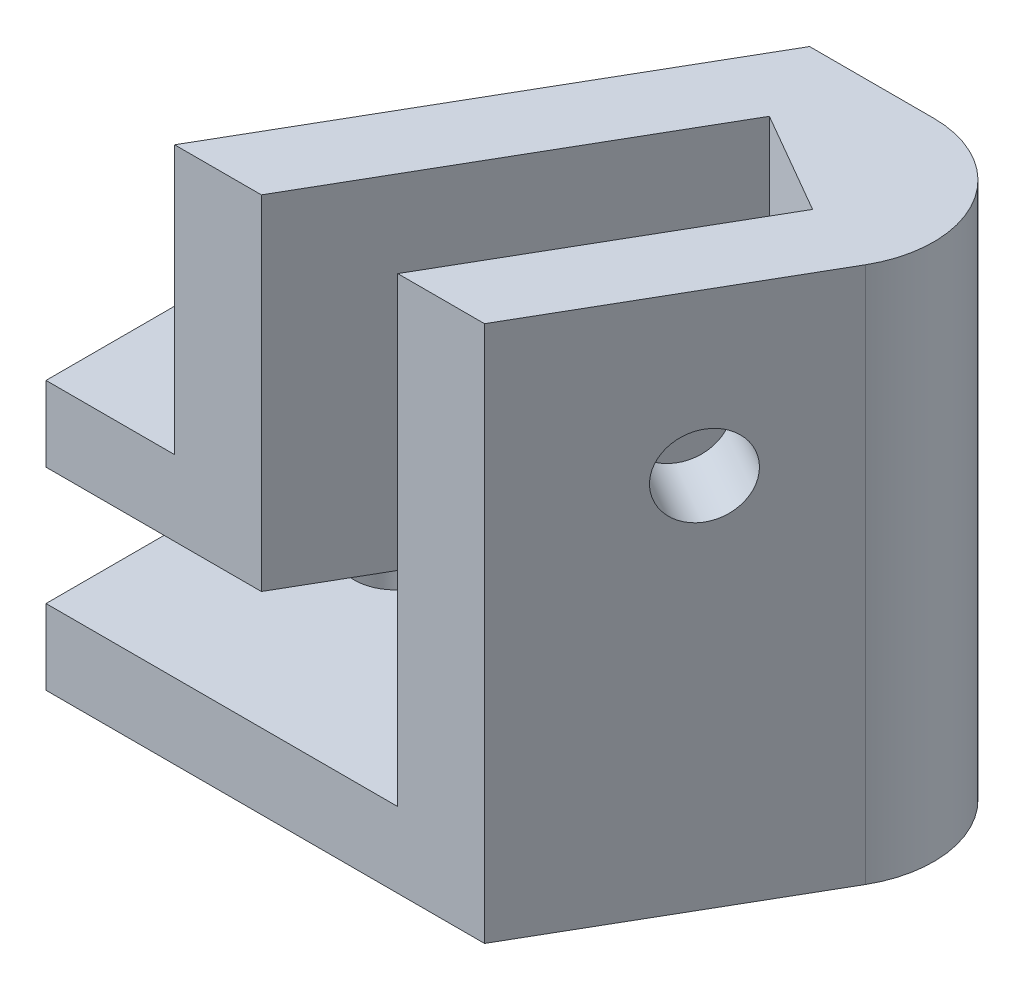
from build123d import *

# Parameters (mm, degrees)
SKETCH_1_W           = 25
SKETCH_1_H           = 15
EXTRUDE_1_DEPTH      = 10
EXTRUDE_2_DEPTH      = 10
CUT_EXTRUDE_1_DEPTH  = 15
CUT_EXTRUDE_2_DEPTH  = 17
CUT_EXTRUDE_3_REACH  = 34.882
SKETCH_5_W           = 12
SKETCH_5_H           = 4.4
EXTRUDE_3_DEPTH      = 12.8
FILLET_1_R           = 4
SKETCH_13_R          = 1.5
CUT_EXTRUDE_10_DEPTH = 20
SKETCH_14_R          = 1.5
CUT_EXTRUDE_11_DEPTH = 20


with BuildPart() as part:
    # Sketch 1 → Extrude 1 (new body)
    with BuildSketch(Plane(origin=(0, 0, 0), x_dir=(1, 0, 0), z_dir=(0, 1, 0))):
        Rectangle(SKETCH_1_W, SKETCH_1_H)
    extrude(amount=EXTRUDE_1_DEPTH)

    # Sketch 2 → Extrude 2 (add)
    with BuildSketch(Plane(origin=(0, 10, 0), x_dir=(1, 0, 0), z_dir=(0, 1, 0))):
        Polygon((0.952994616, 7.5), (-7.707259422, -7.5), (3.839745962, -7.5), (12.5, 7.5), align=None)
    extrude(amount=EXTRUDE_2_DEPTH)

    # Sketch 3 → Cut-Extrude 1 (cut)
    with BuildSketch(Plane(origin=(0, 10, 0), x_dir=(1, 0, 0), z_dir=(0, 1, 0))):
        Polygon((12.5, 7.5), (3.839745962, -7.5), (12.5, -7.5), align=None)
    extrude(amount=-CUT_EXTRUDE_1_DEPTH, mode=Mode.SUBTRACT)

    # Sketch 4 → Cut-Extrude 2 (cut)
    with BuildSketch(Plane(origin=(0, 20, 0), x_dir=(1, 0, 0), z_dir=(0, 1, 0))):
        Polygon((-4.973467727, -8.364933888), (2.454105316, 4.5), (7.534787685, 4.5), (-0.028500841, -8.6), align=None)
    extrude(amount=-CUT_EXTRUDE_2_DEPTH, mode=Mode.SUBTRACT)

    # Cut-Extrude 3: up to this plane
    cut_extrude_3_end = Plane(origin=(-0.028500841, 3, 8.6), z_dir=(0.8660254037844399, 0, 0.4999999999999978))
    # Sketch 5 → Cut-Extrude 3 (cut, up to the surface)
    with BuildSketch(Plane.ZY.offset(12.5), mode=Mode.PRIVATE) as cut_extrude_3_sk1:
        with Locations((1.5, 5)):
            Rectangle(SKETCH_5_W, SKETCH_5_H)
    cut_extrude_3_tool1 = split(extrude(cut_extrude_3_sk1.sketch, amount=-CUT_EXTRUDE_3_REACH, mode=Mode.PRIVATE), bisect_by=cut_extrude_3_end, keep=Keep.BOTH, mode=Mode.PRIVATE)
    add(cut_extrude_3_tool1.solids().sort_by_distance((-12.5, 5, 1.5))[0], mode=Mode.SUBTRACT)

    # Sketch 6 → Extrude 3 (add)
    with BuildSketch(Plane(origin=(0, 20, 0), x_dir=(1, 0, 0), z_dir=(0, 1, 0))):
        Polygon((2.454105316, 4.5), (6.264617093, 2.3), (7.534787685, 4.5), align=None)
    extrude(amount=-EXTRUDE_3_DEPTH)

    # Fillet 1
    fillet_1_edges = [part.edges().sort_by_distance(p)[0] for p in [
        (12.5, 10, -7.5),
    ]]
    fillet(fillet_1_edges, radius=FILLET_1_R)

    # Sketch 13 → Cut-Extrude 10 (cut)
    with BuildSketch(Plane(origin=(-85.669601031, 0, 130.5), x_dir=(-1, 0, 0), z_dir=(0, -1, 0))):
        with Locations(Location((-78.169601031, 131, 0), (0, 0, 90))):
            Circle(SKETCH_13_R)
        with Locations((126.742340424, 131)):
            Circle(SKETCH_13_R)
    extrude(amount=-CUT_EXTRUDE_10_DEPTH, mode=Mode.SUBTRACT)

    # Sketch 14 → Cut-Extrude 11 (cut)
    with BuildSketch(Plane(origin=(-71.798153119, 77.398881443, 138.508684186), x_dir=(0, -1, 0), z_dir=(0.8660254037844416, 0, 0.4999999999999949))):
        with Locations((-71.398881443, 157.275798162)):
            Circle(SKETCH_14_R)
        with Locations(Location((63.398881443, 157.275798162, 0), (0, 0, 90))):
            Circle(SKETCH_14_R)
    extrude(amount=-CUT_EXTRUDE_11_DEPTH, mode=Mode.SUBTRACT)


solid = part.part
